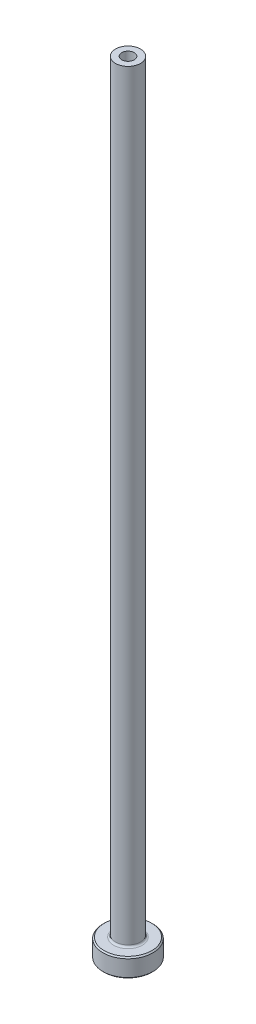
from build123d import *

# Parameters (mm, degrees)
FILLET1_R     = 0.3
CHAMFER1_SIZE = 0.2
CHAMFER3_SIZE = 0.5


with BuildPart() as part:
    # Sketch1 → Revolve1 (revolve)
    with BuildSketch(Plane.XY, mode=Mode.PRIVATE) as revolve1_sk:
        Polygon((-1, 125), (-2, 125), (-2, 3), (-4, 3), (-4, 0), (-1.25, 0), (-1.25, 78), (-1, 90), align=None)
    revolve(revolve1_sk.sketch.rotate(Axis((0, 92.187680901, 0), (0, -1, 0)), 270), axis=Axis((0, 92.187680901, 0), (0, -1, 0)))

    # Fillet1
    fillet1_edges = [part.edges().sort_by_distance(p)[0] for p in [
        (0, 3, -2),
    ]]
    fillet(fillet1_edges, radius=FILLET1_R)

    # Chamfer1
    chamfer1_edges = [part.edges().sort_by_distance(p)[0] for p in [
        (0, 0, -4),
        (0, 3, -4),
    ]]
    chamfer(chamfer1_edges, length=CHAMFER1_SIZE)

    # Chamfer3
    chamfer3_edges = [part.edges().sort_by_distance(p)[0] for p in [
        (0, 0, -1.25),
    ]]
    chamfer(chamfer3_edges, length=CHAMFER3_SIZE)


solid = part.part
